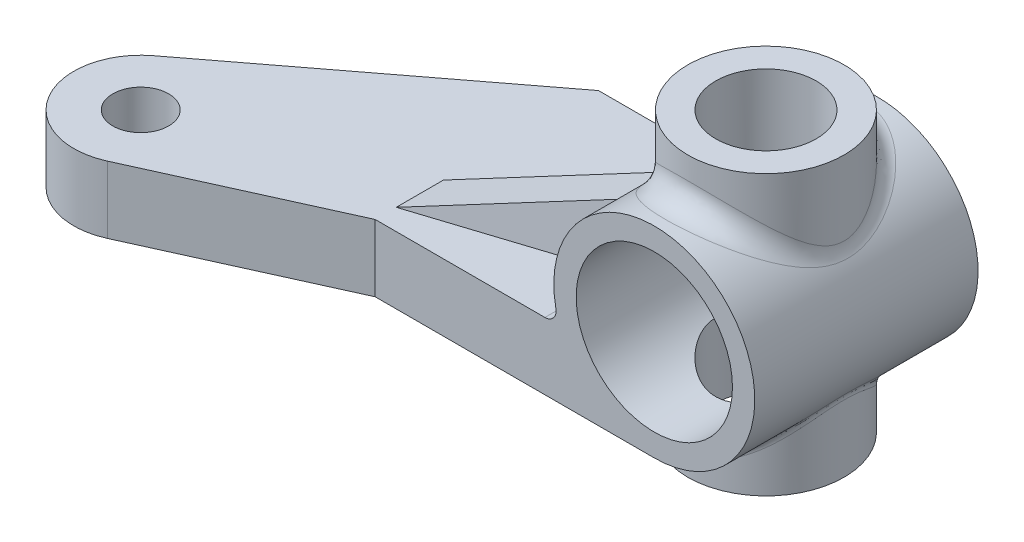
from build123d import *

# Parameters (mm, degrees)
CROQUIS1_R            = 4.5
EXTRUIR1_DEPTH        = 10
EXTRUIR2_DEPTH        = 3
EXTRUIR3_DEPTH        = 11
EXTRUIR3_DEPTH_BACK   = 1.5
CROQUIS3_R            = 3.5
CROQUIS4_R            = 2.25
CORTAR_EXTRUIR1_DEPTH = 32.260998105
CROQUIS5_R            = 3.5
CORTAR_EXTRUIR2_DEPTH = 28.699278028
CROQUIS6_R            = 1.25
CORTAR_EXTRUIR3_DEPTH = 31.692018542
NERVIO1_REACH         = 31.136
REDONDEO1_R           = 1
REDONDEO2_R           = 0.5
REDONDEO3_R           = 0.5


with BuildPart() as part:
    # Croquis1 → Extruir1 (new body)
    with BuildSketch(Plane.XY):
        Circle(CROQUIS1_R)
    extrude(amount=EXTRUIR1_DEPTH)

    # Croquis2 → Extruir2 (add)
    with BuildSketch(Plane(origin=(0, -4.5, 0), x_dir=(-1, 0, 0), z_dir=(0, 1, 0))):
        with BuildLine():
            Line((0, 10), (0, 0))
            Line((0, 0), (12.5, 0))
            Line((12.5, 0), (23.81684387, 8.612725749))
            ThreePointArc((23.81684387, 8.612725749), (24.577069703, 12.535809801), (20.764848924, 13.733935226))
            Line((20.764848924, 13.733935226), (12.5, 10))
            Line((12.5, 10), (0, 10))
        make_face()
    extrude(amount=EXTRUIR2_DEPTH)

    # Croquis3 → Extruir3 (add, two sides: drawn at the far end of the back side and taken through both)
    with BuildSketch(Plane(origin=(0, -4.5, 0), x_dir=(-1, 0, 0), z_dir=(0, 1, 0)).offset(-EXTRUIR3_DEPTH_BACK)):
        with Locations(Location((0, 5, 0), (0, 0, 90))):
            Circle(CROQUIS3_R)
    extrude(amount=EXTRUIR3_DEPTH + EXTRUIR3_DEPTH_BACK)

    # Croquis4 → Cortar-Extruir1 (cut, through all)
    with BuildSketch(Plane.XZ.offset(6)):
        with Locations(Location((0, 5, 0), (0, 0, 270))):
            Circle(CROQUIS4_R)
    extrude(amount=-CORTAR_EXTRUIR1_DEPTH, mode=Mode.SUBTRACT)

    # Croquis5 → Cortar-Extruir2 (cut, through all)
    with BuildSketch(Plane.XY.offset(10)):
        Circle(CROQUIS5_R)
    extrude(amount=-CORTAR_EXTRUIR2_DEPTH, mode=Mode.SUBTRACT)

    # Croquis6 → Cortar-Extruir3 (cut, through all)
    with BuildSketch(Plane.XZ.offset(4.5)):
        with Locations(Location((-22, 11, 0), (0, 0, 270))):
            Circle(CROQUIS6_R)
    extrude(amount=-CORTAR_EXTRUIR3_DEPTH, mode=Mode.SUBTRACT)

    # Croquis9 walls → Nervio1 (add, up to next)
    with BuildSketch(Plane(origin=(-0.962691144, 2.666045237, 0), x_dir=(0.9405592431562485, 0.3396296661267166, 0), z_dir=(0.3396296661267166, -0.9405592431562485, 0)), mode=Mode.PRIVATE) as nervio1_sk1:
        Polygon((-41.104154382, 16.806249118), (24.695428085, -5.698625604), (25.342661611, -3.806249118), (-40.456920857, 18.698625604), align=None)
    nervio1_tool1 = extrude(nervio1_sk1.sketch, amount=NERVIO1_REACH, mode=Mode.PRIVATE) - part.part
    add(nervio1_tool1.solids().sort_by_distance((-8.375, -0.010490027, 6.5))[0])

    # Redondeo1
    redondeo1_edges = [part.edges().sort_by_distance(p)[0] for p in [
        (0, 4.5, 1.5),
    ]]
    fillet(redondeo1_edges, radius=REDONDEO1_R)

    # Redondeo2
    redondeo2_edges = [part.edges().sort_by_distance(p)[0] for p in [
        (-4.242640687, -1.5, 8.200274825),
        (-4.242640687, -1.5, 2.143402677),
    ]]
    fillet(redondeo2_edges, radius=REDONDEO2_R)

    # Redondeo3
    redondeo3_edges = [part.edges().sort_by_distance(p)[0] for p in [
        (-3.5, -4.5, 5),
        (3.5, -2.828427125, 5),
    ]]
    fillet(redondeo3_edges, radius=REDONDEO3_R)


solid = part.part
